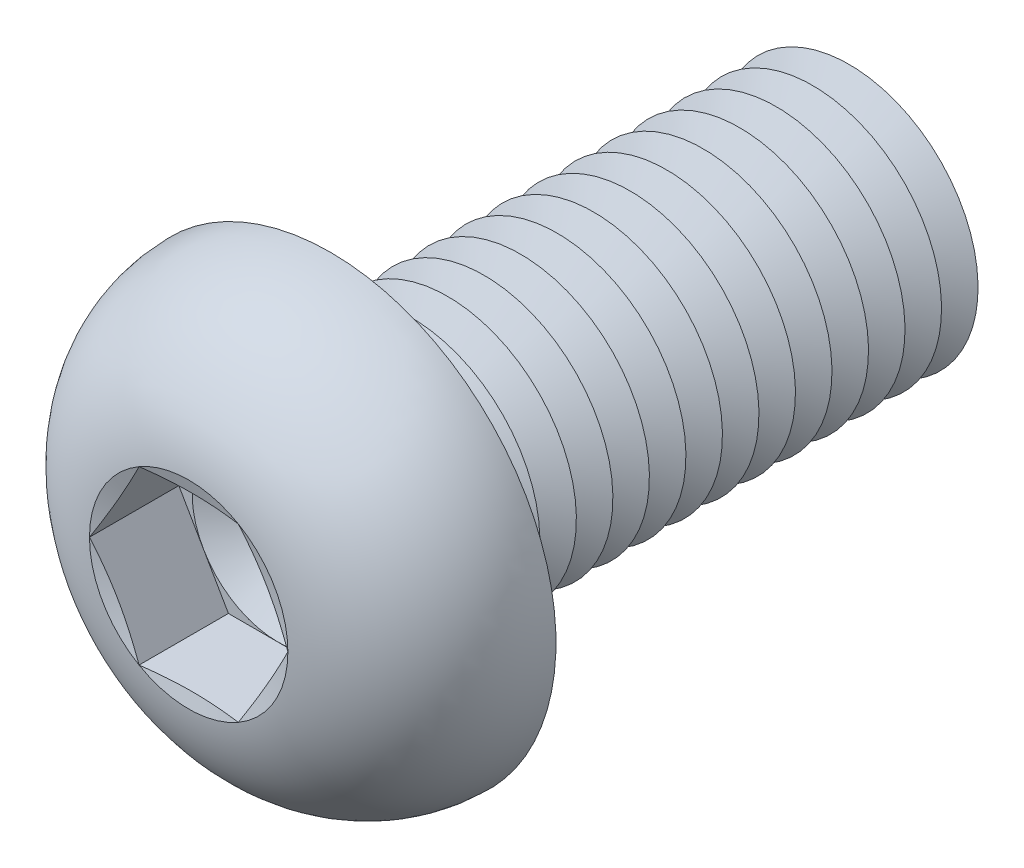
from build123d import *

# Parameters (mm, degrees)
FILLET1_R          = 0.85
LPATTERN1_COUNT    = 14
LPATTERN1_PITCH    = 1.7
CUT_EXTRUDE1_DEPTH = 4.16


with BuildPart() as part:
    # Sketch1 → Revolve1 (revolve)
    with BuildSketch(Plane(origin=(0, 0, 0), x_dir=(0, 0, -1), z_dir=(1, 0, 0))):
        with BuildLine():
            Line((0, 6), (0, 10.5))
            ThreePointArc((0, 10.5), (-4.420082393, 8.816378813), (-6.6, 4.6188))
            Line((-6.6, 4.6188), (-5.981198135, 2.3094))
            Line((-5.981198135, 2.3094), (-6.6, 2.3094))
            Line((-6.6, 2.3094), (-6.6, 0))
            Line((-6.6, 0), (25, 0))
            Line((25, 0), (25, 6))
            Line((25, 6), (0, 6))
        make_face()
    revolve(axis=Axis((0, 0, -25), (0, 0, 1)))

    # Fillet1
    fillet1_edges = [part.edges().sort_by_distance(p)[0] for p in [
        (0, -6, 0),
    ]]
    fillet(fillet1_edges, radius=FILLET1_R)

    # Sketch2 → Cut-Revolve1 (revolve, cut)
    with BuildSketch(Plane(origin=(0, 0, 0), x_dir=(0, 0, -1), z_dir=(1, 0, 0))):
        Polygon((24.15, 6), (25.85, 6), (25, 4.527756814), align=None)
    cut_revolve1 = revolve(axis=Axis((0, 0, -25), (0, 0, -1)), mode=Mode.SUBTRACT)

    # LPattern1: Cut-Revolve1 ×14
    with Locations(*[(0, 0, i * LPATTERN1_PITCH) for i in range(1, LPATTERN1_COUNT)]):
        add(cut_revolve1, mode=Mode.SUBTRACT)

    # Sketch3 → Cut-Extrude1 (cut)
    with BuildSketch(Plane.XY.offset(6.6)):
        Polygon((2.3094, 3.999998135), (-2.3094, 3.999998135), (-4.6188, 0), (-2.3094, -3.999998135), (2.3094, -3.999998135), (4.6188, 0), align=None)
    extrude(amount=-CUT_EXTRUDE1_DEPTH, mode=Mode.SUBTRACT)

    # Cut-Extrude2 cone 1 section (on through the dimple's axis) → Cut-Extrude2 (revolve, cut)
    with BuildSketch(Plane(origin=(0, 0, 2.44), x_dir=(0, -1, 0), z_dir=(1, 0, 0))):
        Polygon((0, 0), (3.999998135, 0), (0, 2.3094), align=None)
    revolve(axis=Axis((0, 0, 2.44), (0, 0, -1)), mode=Mode.SUBTRACT)


solid = part.part
